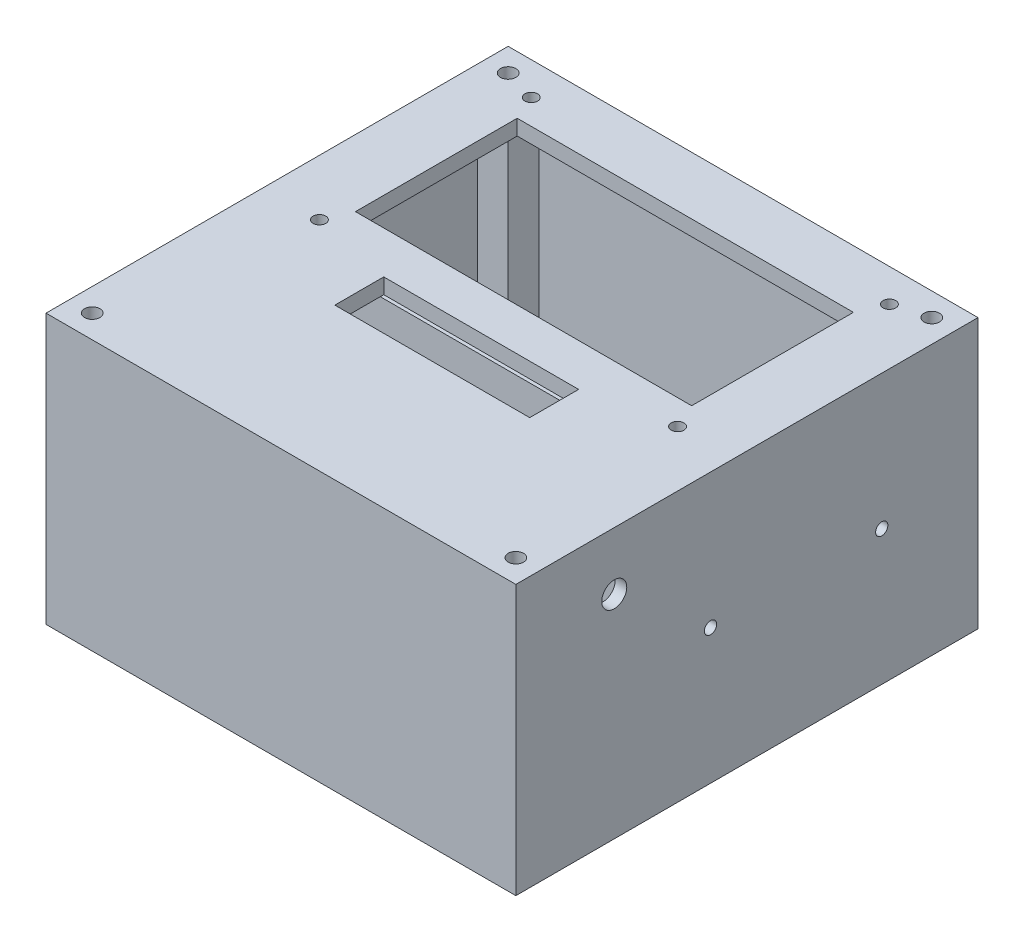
from build123d import *

# Parameters (mm, degrees)
BOSS_EXTRUDE_MAIN_CASE_DEPTH           = 60
BOSS_EXTRUDE_MAIN_CASE_DEPTH_BACK      = 10
SKETCH1_W                              = 122
SKETCH1_H                              = 120
SKETCH_MAIN_HOLE_W                     = 116
SKETCH_MAIN_HOLE_H                     = 114
CUT_EXTRUDE_MAIN_DEPTH                 = 66
SKETCH_LCD_BEZEL_W                     = 87.3
SKETCH_LCD_BEZEL_H                     = 42
CUT_EXTRUDE_LCD_DEPTH                  = 47.15
SKETCH26_R                             = 1.65
CUT_EXTRUDE_LCD_SCREWS_DEPTH           = 111.548631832
SKETCH34_W                             = 9.525
SKETCH34_H                             = 42
BOSS_EXTRUDE_SOLENOID_BASE_DEPTH       = 54
CUT_EXTRUDE_SOLENOID_SCREWS_REACH      = 129.462
SKETCH38_R                             = 1.5
SKETCH41_R                             = 8.5
CUT_EXTRUDE_SOLENOID_HOLE_DEPTH        = 147.15402834
CUT_EXTRUDE_BATTERY_HOLDER_REACH       = 150.607
SKETCH53_R                             = 1.5875
SKETCH53_R_2                           = 3.25
CUT_EXTRUDE_POWER_SWITCH_REACH         = 149.38
SKETCH58_W                             = 14
SKETCH58_H                             = 12
SKETCH60_W                             = 8
SKETCH60_H                             = 8
BOSS_EXTRUDE_CORNER_STANDOFFS_DEPTH    = 66
SKETCH62_R                             = 2
SKETCH62_R_2                           = 1.999996
CUT_EXTRUDE_CORNER_HOLES_DEPTH         = 111.548631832
CUT_EXTRUDE_KEYPAD_REACH               = 112.549
SKETCH59_W                             = 50.6
SKETCH59_H                             = 12.7
SKETCH65_W                             = 6.35
SKETCH65_H                             = 57.15
BOSS_EXTRUDE_PCB_BASE_DEPTH            = 91.5
CUT_EXTRUDE_PCB_ACDC_BARREL_JACK_REACH = 148.154
SKETCH67_R                             = 2.75
SKETCH71_R                             = 2.413
CUT_EXTRUDE_PCB_BASE_SCREWS_DEPTH      = 38.1
SKETCH74_R                             = 2.413
CUT_EXTRUDE_SOLENOID_BASE_SCREWS_DEPTH = 38.1


with BuildPart() as part:
    # Sketch1 → Boss-Extrude_MAIN_CASE (new, two sides: drawn at the far end of the back side and taken through both)
    with BuildSketch(Plane(origin=(0, 0, 0), x_dir=(1, 0, 0), z_dir=(0, 1, 0)).offset(-BOSS_EXTRUDE_MAIN_CASE_DEPTH_BACK)):
        Rectangle(SKETCH1_W, SKETCH1_H)
    extrude(amount=BOSS_EXTRUDE_MAIN_CASE_DEPTH + BOSS_EXTRUDE_MAIN_CASE_DEPTH_BACK)

    # Sketch_MAIN_HOLE → Cut-Extrude_MAIN (cut)
    with BuildSketch(Plane.XZ.offset(10)):
        Rectangle(SKETCH_MAIN_HOLE_W, SKETCH_MAIN_HOLE_H)
    extrude(amount=-CUT_EXTRUDE_MAIN_DEPTH, mode=Mode.SUBTRACT)

    # Sketch_LCD_BEZEL → Cut-Extrude_LCD (cut)
    with BuildSketch(Plane(origin=(0, 60, 0), x_dir=(1, 0, 0), z_dir=(0, 1, 0))):
        with Locations((0, 24)):
            Rectangle(SKETCH_LCD_BEZEL_W, SKETCH_LCD_BEZEL_H)
    extrude(amount=-CUT_EXTRUDE_LCD_DEPTH, mode=Mode.SUBTRACT)

    # Sketch26 → Cut-Extrude_LCD_SCREWS (cut, through all)
    with BuildSketch(Plane(origin=(0, 60, 0), x_dir=(1, 0, 0), z_dir=(0, 1, 0))):
        with Locations(Location((-46.5, 51.5, 0), (0, 0, 270))):
            Circle(SKETCH26_R)
        with Locations(Location((46.5, 51.5, 0), (0, 0, 270))):
            Circle(SKETCH26_R)
        with Locations(Location((46.5, -3.5, 0), (0, 0, 270))):
            Circle(SKETCH26_R)
        with Locations(Location((-46.5, -3.5, 0), (0, 0, 270))):
            Circle(SKETCH26_R)
    extrude(amount=-CUT_EXTRUDE_LCD_SCREWS_DEPTH, mode=Mode.SUBTRACT)

    # Sketch34 → Boss-Extrude_SOLENOID_BASE (add)
    with BuildSketch(Plane(origin=(-58, 0, 0), x_dir=(0, 0, -1), z_dir=(1, 0, 0))):
        with Locations((-39.2375, 23)):
            Rectangle(SKETCH34_W, SKETCH34_H)
    extrude(amount=BOSS_EXTRUDE_SOLENOID_BASE_DEPTH)

    # Sketch38 → Cut-Extrude_SOLENOID_SCREWS (cut, up to next)
    with BuildSketch(Plane(origin=(0, 0, 34.475), x_dir=(-1, 0, 0), z_dir=(0, 0, -1)), mode=Mode.PRIVATE) as cut_extrude_solenoid_screws_sk1:
        with Locations(Location((48, 7, 0), (0, 0, 90))):
            Circle(SKETCH38_R)
    cut_extrude_solenoid_screws_tool1 = extrude(cut_extrude_solenoid_screws_sk1.sketch, amount=-CUT_EXTRUDE_SOLENOID_SCREWS_REACH, mode=Mode.PRIVATE) & part.part
    # Sketch38 → Cut-Extrude_SOLENOID_SCREWS (cut, up to next)
    with BuildSketch(Plane(origin=(0, 0, 34.475), x_dir=(-1, 0, 0), z_dir=(0, 0, -1)), mode=Mode.PRIVATE) as cut_extrude_solenoid_screws_sk2:
        with Locations(Location((14, 7, 0), (0, 0, 90))):
            Circle(SKETCH38_R)
    cut_extrude_solenoid_screws_tool2 = extrude(cut_extrude_solenoid_screws_sk2.sketch, amount=-CUT_EXTRUDE_SOLENOID_SCREWS_REACH, mode=Mode.PRIVATE) & part.part
    # Sketch38 → Cut-Extrude_SOLENOID_SCREWS (cut, up to next)
    with BuildSketch(Plane(origin=(0, 0, 34.475), x_dir=(-1, 0, 0), z_dir=(0, 0, -1)), mode=Mode.PRIVATE) as cut_extrude_solenoid_screws_sk3:
        with Locations(Location((48, 39, 0), (0, 0, 90))):
            Circle(SKETCH38_R)
    cut_extrude_solenoid_screws_tool3 = extrude(cut_extrude_solenoid_screws_sk3.sketch, amount=-CUT_EXTRUDE_SOLENOID_SCREWS_REACH, mode=Mode.PRIVATE) & part.part
    # Sketch38 → Cut-Extrude_SOLENOID_SCREWS (cut, up to next)
    with BuildSketch(Plane(origin=(0, 0, 34.475), x_dir=(-1, 0, 0), z_dir=(0, 0, -1)), mode=Mode.PRIVATE) as cut_extrude_solenoid_screws_sk4:
        with Locations(Location((14, 39, 0), (0, 0, 90))):
            Circle(SKETCH38_R)
    cut_extrude_solenoid_screws_tool4 = extrude(cut_extrude_solenoid_screws_sk4.sketch, amount=-CUT_EXTRUDE_SOLENOID_SCREWS_REACH, mode=Mode.PRIVATE) & part.part
    add(cut_extrude_solenoid_screws_tool1.solids().sort_by_distance((-48, 7, 34.475))[0], mode=Mode.SUBTRACT)
    add(cut_extrude_solenoid_screws_tool2.solids().sort_by_distance((-14, 7, 34.475))[0], mode=Mode.SUBTRACT)
    add(cut_extrude_solenoid_screws_tool3.solids().sort_by_distance((-48, 39, 34.475))[0], mode=Mode.SUBTRACT)
    add(cut_extrude_solenoid_screws_tool4.solids().sort_by_distance((-14, 39, 34.475))[0], mode=Mode.SUBTRACT)

    # Sketch41 → Cut-Extrude_SOLENOID_HOLE (cut, through all)
    with BuildSketch(Plane(origin=(-58, 0, 0), x_dir=(0, 0, -1), z_dir=(1, 0, 0))):
        with Locations((-21.225, 23)):
            Circle(SKETCH41_R)
    extrude(amount=-CUT_EXTRUDE_SOLENOID_HOLE_DEPTH, mode=Mode.SUBTRACT)

    # Sketch53 → Cut-Extrude_BATTERY_HOLDER (cut, up to next)
    with BuildSketch(Plane(origin=(61, 0, 0), x_dir=(0, 0, -1), z_dir=(1, 0, 0)), mode=Mode.PRIVATE) as cut_extrude_battery_holder_sk1:
        with Locations((-9.45, 25)):
            Circle(SKETCH53_R)
    cut_extrude_battery_holder_tool1 = extrude(cut_extrude_battery_holder_sk1.sketch, amount=-CUT_EXTRUDE_BATTERY_HOLDER_REACH, mode=Mode.PRIVATE) & part.part
    # Sketch53 → Cut-Extrude_BATTERY_HOLDER (cut, up to next)
    with BuildSketch(Plane(origin=(61, 0, 0), x_dir=(0, 0, -1), z_dir=(1, 0, 0)), mode=Mode.PRIVATE) as cut_extrude_battery_holder_sk2:
        with Locations((35, 25)):
            Circle(SKETCH53_R)
    cut_extrude_battery_holder_tool2 = extrude(cut_extrude_battery_holder_sk2.sketch, amount=-CUT_EXTRUDE_BATTERY_HOLDER_REACH, mode=Mode.PRIVATE) & part.part
    # Sketch53 → Cut-Extrude_BATTERY_HOLDER (cut, up to next)
    with BuildSketch(Plane(origin=(61, 0, 0), x_dir=(0, 0, -1), z_dir=(1, 0, 0)), mode=Mode.PRIVATE) as cut_extrude_battery_holder_sk3:
        with Locations((-34.45, 45)):
            Circle(SKETCH53_R_2)
    cut_extrude_battery_holder_tool3 = extrude(cut_extrude_battery_holder_sk3.sketch, amount=-CUT_EXTRUDE_BATTERY_HOLDER_REACH, mode=Mode.PRIVATE) & part.part
    add(cut_extrude_battery_holder_tool1.solids().sort_by_distance((61, 25, 9.45))[0], mode=Mode.SUBTRACT)
    add(cut_extrude_battery_holder_tool2.solids().sort_by_distance((61, 25, -35))[0], mode=Mode.SUBTRACT)
    add(cut_extrude_battery_holder_tool3.solids().sort_by_distance((61, 45, 34.45))[0], mode=Mode.SUBTRACT)

    # Sketch58 → Cut-Extrude_POWER_SWITCH (cut, up to next)
    with BuildSketch(Plane(origin=(0, 0, -60), x_dir=(-1, 0, 0), z_dir=(0, 0, -1)), mode=Mode.PRIVATE) as cut_extrude_power_switch_sk1:
        with Locations((-31, 25)):
            Rectangle(SKETCH58_W, SKETCH58_H)
    cut_extrude_power_switch_tool1 = extrude(cut_extrude_power_switch_sk1.sketch, amount=-CUT_EXTRUDE_POWER_SWITCH_REACH, mode=Mode.PRIVATE) & part.part
    add(cut_extrude_power_switch_tool1.solids().sort_by_distance((31, 25, -60))[0], mode=Mode.SUBTRACT)

    # Sketch60 → Boss-Extrude_CORNER_STANDOFFS (add)
    with BuildSketch(Plane.XZ.offset(-56)):
        with Locations((-54, -53)):
            Rectangle(SKETCH60_W, SKETCH60_H)
        with Locations((-54, 53)):
            Rectangle(SKETCH60_W, SKETCH60_H)
        with Locations((54, 53)):
            Rectangle(SKETCH60_W, SKETCH60_H)
        with Locations((54, -53)):
            Rectangle(SKETCH60_W, SKETCH60_H)
    extrude(amount=BOSS_EXTRUDE_CORNER_STANDOFFS_DEPTH)

    # Sketch62 → Cut-Extrude_CORNER_HOLES (cut, through all)
    with BuildSketch(Plane(origin=(0, -10, 0), x_dir=(-1, 0, 0), z_dir=(0, -1, 0))):
        with Locations(Location((55, -54, 0), (0, 0, 90))):
            Circle(SKETCH62_R)
        with Locations(Location((-55, -54, 0), (0, 0, 90))):
            Circle(SKETCH62_R)
        with Locations(Location((55, 54, 0), (0, 0, 90))):
            Circle(SKETCH62_R)
        with Locations(Location((-55, 54, 0), (0, 0, 90))):
            Circle(SKETCH62_R_2)
    extrude(amount=-CUT_EXTRUDE_CORNER_HOLES_DEPTH, mode=Mode.SUBTRACT)

    # Sketch59 → Cut-Extrude_KEYPAD (cut, up to next)
    with BuildSketch(Plane(origin=(0, 60, 0), x_dir=(1, 0, 0), z_dir=(0, 1, 0)), mode=Mode.PRIVATE) as cut_extrude_keypad_sk1:
        with Locations((0, -14.35)):
            Rectangle(SKETCH59_W, SKETCH59_H)
    cut_extrude_keypad_tool1 = extrude(cut_extrude_keypad_sk1.sketch, amount=-CUT_EXTRUDE_KEYPAD_REACH, mode=Mode.PRIVATE) & part.part
    add(cut_extrude_keypad_tool1.solids().sort_by_distance((0, 60, 14.35))[0], mode=Mode.SUBTRACT)

    # Sketch65 → Boss-Extrude_PCB_BASE (add)
    with BuildSketch(Plane(origin=(-58, 0, 0), x_dir=(0, 0, -1), z_dir=(1, 0, 0))):
        with Locations((-1.3, 23)):
            Rectangle(SKETCH65_W, SKETCH65_H)
    extrude(amount=BOSS_EXTRUDE_PCB_BASE_DEPTH)

    # Sketch67 → Cut-Extrude_PCB_ACDC_BARREL_JACK (cut, up to next)
    with BuildSketch(Plane(origin=(-58, 0, 0), x_dir=(0, 0, -1), z_dir=(1, 0, 0)), mode=Mode.PRIVATE) as cut_extrude_pcb_acdc_barrel_jack_sk1:
        with Locations((8.375, 46.575)):
            Circle(SKETCH67_R)
    cut_extrude_pcb_acdc_barrel_jack_tool1 = extrude(cut_extrude_pcb_acdc_barrel_jack_sk1.sketch, amount=-CUT_EXTRUDE_PCB_ACDC_BARREL_JACK_REACH, mode=Mode.PRIVATE) & part.part
    add(cut_extrude_pcb_acdc_barrel_jack_tool1.solids().sort_by_distance((-58, 46.575, -8.375))[0], mode=Mode.SUBTRACT)

    # Sketch71 → Cut-Extrude_PCB_BASE_SCREWS (cut)
    with BuildSketch(Plane.ZY.offset(61)):
        with Locations((1.3114, 39.149)):
            Circle(SKETCH71_R)
        with Locations((1.3114, 6.8402)):
            Circle(SKETCH71_R)
    extrude(amount=-CUT_EXTRUDE_PCB_BASE_SCREWS_DEPTH, mode=Mode.SUBTRACT)

    # Sketch74 → Cut-Extrude_SOLENOID_BASE_SCREWS (cut)
    with BuildSketch(Plane.ZY.offset(61)):
        with Locations((39.233563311, 13.4188)):
            Circle(SKETCH74_R)
        with Locations((39.246263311, 32.5704)):
            Circle(SKETCH74_R)
    extrude(amount=-CUT_EXTRUDE_SOLENOID_BASE_SCREWS_DEPTH, mode=Mode.SUBTRACT)


solid = part.part
